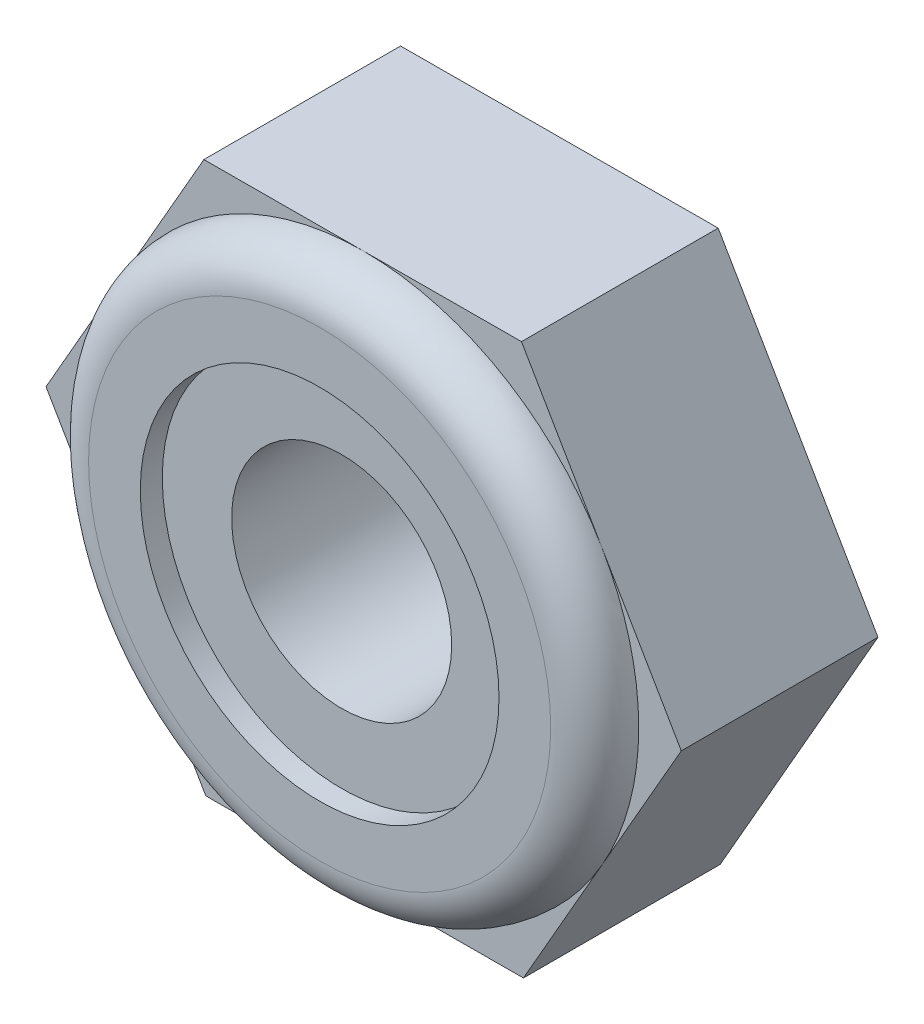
ISO-10303-21;
HEADER;
FILE_DESCRIPTION(('STEP AP214'),'2;1');
FILE_NAME('part.step','',(''),(''),'','','');
FILE_SCHEMA(('AUTOMOTIVE_DESIGN { 1 0 10303 214 1 1 1 1 }'));
ENDSEC;
DATA;
#1=APPLICATION_CONTEXT('core data for automotive mechanical design processes');
#2=APPLICATION_PROTOCOL_DEFINITION('international standard','automotive_design',2000,#1);
#3=PRODUCT_CONTEXT('',#1,'mechanical');
#4=PRODUCT('Part','Part','',(#3));
#5=PRODUCT_RELATED_PRODUCT_CATEGORY('part','',(#4));
#6=PRODUCT_DEFINITION_FORMATION('','',#4);
#7=PRODUCT_DEFINITION_CONTEXT('part definition',#1,'design');
#8=PRODUCT_DEFINITION('design','',#6,#7);
#9=PRODUCT_DEFINITION_SHAPE('','',#8);
#10=(LENGTH_UNIT() NAMED_UNIT(*) SI_UNIT(.MILLI.,.METRE.));
#11=(NAMED_UNIT(*) PLANE_ANGLE_UNIT() SI_UNIT($,.RADIAN.));
#12=(NAMED_UNIT(*) SI_UNIT($,.STERADIAN.) SOLID_ANGLE_UNIT());
#13=UNCERTAINTY_MEASURE_WITH_UNIT(LENGTH_MEASURE(1.E-05),#10,'distance_accuracy_value','');
#14=(GEOMETRIC_REPRESENTATION_CONTEXT(3) GLOBAL_UNCERTAINTY_ASSIGNED_CONTEXT((#13)) GLOBAL_UNIT_ASSIGNED_CONTEXT((#10,
#11,#12)) REPRESENTATION_CONTEXT('',''));
#15=CARTESIAN_POINT('',(0.,0.,0.));
#16=DIRECTION('',(0.,0.,1.));
#17=DIRECTION('',(1.,0.,0.));
#18=AXIS2_PLACEMENT_3D('',#15,#16,#17);
#19=CARTESIAN_POINT('',(0.,0.,0.));
#20=DIRECTION('',(0.,0.,1.));
#21=DIRECTION('',(1.,0.,0.));
#22=AXIS2_PLACEMENT_3D('',#19,#20,#21);
#23=CYLINDRICAL_SURFACE('',#22,1.27);
#24=CARTESIAN_POINT('',(0.,0.,0.));
#25=DIRECTION('',(0.,0.,1.));
#26=DIRECTION('',(1.,0.,0.));
#27=AXIS2_PLACEMENT_3D('',#24,#25,#26);
#28=CIRCLE('',#27,1.27);
#29=CARTESIAN_POINT('',(1.27,0.,0.));
#30=VERTEX_POINT('',#29);
#31=EDGE_CURVE('E131',#30,#30,#28,.T.);
#32=ORIENTED_EDGE('',*,*,#31,.F.);
#33=EDGE_LOOP('',(#32));
#34=FACE_BOUND('',#33,.T.);
#35=CARTESIAN_POINT('',(0.,0.,2.524125));
#36=DIRECTION('',(0.,0.,1.));
#37=DIRECTION('',(1.,0.,0.));
#38=AXIS2_PLACEMENT_3D('',#35,#36,#37);
#39=CIRCLE('',#38,1.27);
#40=CARTESIAN_POINT('',(1.27,0.,2.524125));
#41=VERTEX_POINT('',#40);
#42=EDGE_CURVE('E34',#41,#41,#39,.F.);
#43=ORIENTED_EDGE('',*,*,#42,.F.);
#44=EDGE_LOOP('',(#43));
#45=FACE_BOUND('',#44,.T.);
#46=ADVANCED_FACE('F30',(#34,#45),#23,.F.);
#47=CARTESIAN_POINT('',(-1.8218133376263,-3.18148227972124,2.270125));
#48=DIRECTION('',(0.,0.,-1.));
#49=DIRECTION('',(-1.,0.,0.));
#50=AXIS2_PLACEMENT_3D('',#47,#48,#49);
#51=PLANE('',#50);
#52=CARTESIAN_POINT('',(0.,0.,2.270125));
#53=DIRECTION('',(0.,0.,1.));
#54=DIRECTION('',(1.,0.,0.));
#55=AXIS2_PLACEMENT_3D('',#52,#53,#54);
#56=CIRCLE('',#55,3.175);
#57=CARTESIAN_POINT('',(2.74398224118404,1.59724339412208,2.270125));
#58=VERTEX_POINT('',#57);
#59=CARTESIAN_POINT('',(-0.0112622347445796,3.17498002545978,2.270125));
#60=VERTEX_POINT('',#59);
#61=EDGE_CURVE('E125',#58,#60,#56,.T.);
#62=ORIENTED_EDGE('',*,*,#61,.F.);
#63=DIRECTION('',(-0.503068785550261,0.864246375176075,0.));
#64=VECTOR('',#63,1.);
#65=CARTESIAN_POINT('',(3.66615114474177,0.0130045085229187,2.270125));
#66=LINE('',#65,#64);
#67=CARTESIAN_POINT('',(1.82181333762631,3.18148227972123,2.270125));
#68=VERTEX_POINT('',#67);
#69=EDGE_CURVE('E113',#58,#68,#66,.T.);
#70=ORIENTED_EDGE('',*,*,#69,.T.);
#71=DIRECTION('',(-0.999993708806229,-0.00354716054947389,0.));
#72=VECTOR('',#71,1.);
#73=CARTESIAN_POINT('',(1.82181333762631,3.18148227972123,2.270125));
#74=LINE('',#73,#72);
#75=EDGE_CURVE('E127',#68,#60,#74,.T.);
#76=ORIENTED_EDGE('',*,*,#75,.T.);
#77=EDGE_LOOP('',(#62,#70,#76));
#78=FACE_BOUND('',#77,.T.);
#79=ADVANCED_FACE('F126',(#78),#51,.F.);
#80=CARTESIAN_POINT('',(-2.75524447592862,1.5777366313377,2.270125));
#81=VERTEX_POINT('',#80);
#82=EDGE_CURVE('E39',#60,#81,#56,.T.);
#83=ORIENTED_EDGE('',*,*,#82,.F.);
#84=CARTESIAN_POINT('',(-1.84433780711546,3.16847777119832,2.270125));
#85=VERTEX_POINT('',#84);
#86=EDGE_CURVE('E112',#60,#85,#74,.T.);
#87=ORIENTED_EDGE('',*,*,#86,.T.);
#88=DIRECTION('',(-0.496924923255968,-0.867793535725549,0.));
#89=VECTOR('',#88,1.);
#90=CARTESIAN_POINT('',(-1.84433780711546,3.16847777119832,2.270125));
#91=LINE('',#90,#89);
#92=EDGE_CURVE('E164',#85,#81,#91,.T.);
#93=ORIENTED_EDGE('',*,*,#92,.T.);
#94=EDGE_LOOP('',(#83,#87,#93));
#95=FACE_BOUND('',#94,.T.);
#96=ADVANCED_FACE('F197',(#95),#51,.F.);
#97=CARTESIAN_POINT('',(-2.74398224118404,-1.59724339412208,2.270125));
#98=VERTEX_POINT('',#97);
#99=EDGE_CURVE('E54',#81,#98,#56,.T.);
#100=ORIENTED_EDGE('',*,*,#99,.F.);
#101=CARTESIAN_POINT('',(-3.66615114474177,-0.0130045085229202,2.270125));
#102=VERTEX_POINT('',#101);
#103=EDGE_CURVE('E163',#81,#102,#91,.T.);
#104=ORIENTED_EDGE('',*,*,#103,.T.);
#105=DIRECTION('',(0.503068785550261,-0.864246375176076,0.));
#106=VECTOR('',#105,1.);
#107=CARTESIAN_POINT('',(-3.66615114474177,-0.0130045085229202,2.270125));
#108=LINE('',#107,#106);
#109=EDGE_CURVE('E168',#102,#98,#108,.T.);
#110=ORIENTED_EDGE('',*,*,#109,.T.);
#111=EDGE_LOOP('',(#100,#104,#110));
#112=FACE_BOUND('',#111,.T.);
#113=ADVANCED_FACE('F210',(#112),#51,.F.);
#114=CARTESIAN_POINT('',(0.0112622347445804,-3.17498002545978,2.270125));
#115=VERTEX_POINT('',#114);
#116=EDGE_CURVE('E46',#98,#115,#56,.T.);
#117=ORIENTED_EDGE('',*,*,#116,.F.);
#118=CARTESIAN_POINT('',(-1.8218133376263,-3.18148227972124,2.270125));
#119=VERTEX_POINT('',#118);
#120=EDGE_CURVE('E167',#98,#119,#108,.T.);
#121=ORIENTED_EDGE('',*,*,#120,.T.);
#122=DIRECTION('',(0.999993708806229,0.00354716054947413,0.));
#123=VECTOR('',#122,1.);
#124=CARTESIAN_POINT('',(-1.8218133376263,-3.18148227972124,2.270125));
#125=LINE('',#124,#123);
#126=EDGE_CURVE('E158',#119,#115,#125,.T.);
#127=ORIENTED_EDGE('',*,*,#126,.T.);
#128=EDGE_LOOP('',(#117,#121,#127));
#129=FACE_BOUND('',#128,.T.);
#130=ADVANCED_FACE('F205',(#129),#51,.F.);
#131=CARTESIAN_POINT('',(2.75524447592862,-1.5777366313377,2.270125));
#132=VERTEX_POINT('',#131);
#133=EDGE_CURVE('E137',#115,#132,#56,.T.);
#134=ORIENTED_EDGE('',*,*,#133,.F.);
#135=CARTESIAN_POINT('',(1.84433780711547,-3.16847777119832,2.270125));
#136=VERTEX_POINT('',#135);
#137=EDGE_CURVE('E157',#115,#136,#125,.T.);
#138=ORIENTED_EDGE('',*,*,#137,.T.);
#139=DIRECTION('',(0.496924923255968,0.86779353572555,0.));
#140=VECTOR('',#139,1.);
#141=CARTESIAN_POINT('',(1.84433780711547,-3.16847777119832,2.270125));
#142=LINE('',#141,#140);
#143=EDGE_CURVE('E123',#136,#132,#142,.T.);
#144=ORIENTED_EDGE('',*,*,#143,.T.);
#145=EDGE_LOOP('',(#134,#138,#144));
#146=FACE_BOUND('',#145,.T.);
#147=ADVANCED_FACE('F200',(#146),#51,.F.);
#148=EDGE_CURVE('E106',#132,#58,#56,.T.);
#149=ORIENTED_EDGE('',*,*,#148,.F.);
#150=CARTESIAN_POINT('',(3.66615114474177,0.0130045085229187,2.270125));
#151=VERTEX_POINT('',#150);
#152=EDGE_CURVE('E108',#132,#151,#142,.T.);
#153=ORIENTED_EDGE('',*,*,#152,.T.);
#154=EDGE_CURVE('E102',#151,#58,#66,.T.);
#155=ORIENTED_EDGE('',*,*,#154,.T.);
#156=EDGE_LOOP('',(#149,#153,#155));
#157=FACE_BOUND('',#156,.T.);
#158=ADVANCED_FACE('F104',(#157),#51,.F.);
#159=CARTESIAN_POINT('',(-1.8218133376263,-3.18148227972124,2.270125));
#160=DIRECTION('',(-0.00354716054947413,0.999993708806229,0.));
#161=DIRECTION('',(-0.999993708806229,-0.00354716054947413,0.));
#162=AXIS2_PLACEMENT_3D('',#159,#160,#161);
#163=PLANE('',#162);
#164=DIRECTION('',(0.999993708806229,0.00354716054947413,0.));
#165=VECTOR('',#164,1.);
#166=CARTESIAN_POINT('',(-1.8218133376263,-3.18148227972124,0.));
#167=LINE('',#166,#165);
#168=CARTESIAN_POINT('',(-1.8218133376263,-3.18148227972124,0.));
#169=VERTEX_POINT('',#168);
#170=CARTESIAN_POINT('',(1.84433780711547,-3.16847777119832,0.));
#171=VERTEX_POINT('',#170);
#172=EDGE_CURVE('E130',#169,#171,#167,.T.);
#173=ORIENTED_EDGE('',*,*,#172,.T.);
#174=DIRECTION('',(0.,0.,-1.));
#175=VECTOR('',#174,1.);
#176=CARTESIAN_POINT('',(1.84433780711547,-3.16847777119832,2.270125));
#177=LINE('',#176,#175);
#178=EDGE_CURVE('E138',#136,#171,#177,.T.);
#179=ORIENTED_EDGE('',*,*,#178,.F.);
#180=ORIENTED_EDGE('',*,*,#137,.F.);
#181=ORIENTED_EDGE('',*,*,#126,.F.);
#182=DIRECTION('',(0.,0.,-1.));
#183=VECTOR('',#182,1.);
#184=CARTESIAN_POINT('',(-1.8218133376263,-3.18148227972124,2.270125));
#185=LINE('',#184,#183);
#186=EDGE_CURVE('E170',#119,#169,#185,.T.);
#187=ORIENTED_EDGE('',*,*,#186,.T.);
#188=EDGE_LOOP('',(#173,#179,#180,#181,#187));
#189=FACE_BOUND('',#188,.T.);
#190=ADVANCED_FACE('F32',(#189),#163,.F.);
#191=CARTESIAN_POINT('',(1.84433780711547,-3.16847777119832,2.270125));
#192=DIRECTION('',(-0.867793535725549,0.496924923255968,0.));
#193=DIRECTION('',(-0.496924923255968,-0.86779353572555,0.));
#194=AXIS2_PLACEMENT_3D('',#191,#192,#193);
#195=PLANE('',#194);
#196=DIRECTION('',(0.496924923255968,0.86779353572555,0.));
#197=VECTOR('',#196,1.);
#198=CARTESIAN_POINT('',(1.84433780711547,-3.16847777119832,0.));
#199=LINE('',#198,#197);
#200=CARTESIAN_POINT('',(3.66615114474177,0.0130045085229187,0.));
#201=VERTEX_POINT('',#200);
#202=EDGE_CURVE('E147',#171,#201,#199,.T.);
#203=ORIENTED_EDGE('',*,*,#202,.T.);
#204=DIRECTION('',(0.,0.,-1.));
#205=VECTOR('',#204,1.);
#206=CARTESIAN_POINT('',(3.66615114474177,0.0130045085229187,2.270125));
#207=LINE('',#206,#205);
#208=EDGE_CURVE('E140',#151,#201,#207,.T.);
#209=ORIENTED_EDGE('',*,*,#208,.F.);
#210=ORIENTED_EDGE('',*,*,#152,.F.);
#211=ORIENTED_EDGE('',*,*,#143,.F.);
#212=ORIENTED_EDGE('',*,*,#178,.T.);
#213=EDGE_LOOP('',(#203,#209,#210,#211,#212));
#214=FACE_BOUND('',#213,.T.);
#215=ADVANCED_FACE('F329',(#214),#195,.F.);
#216=CARTESIAN_POINT('',(3.66615114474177,0.0130045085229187,2.270125));
#217=DIRECTION('',(-0.864246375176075,-0.503068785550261,0.));
#218=DIRECTION('',(0.503068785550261,-0.864246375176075,0.));
#219=AXIS2_PLACEMENT_3D('',#216,#217,#218);
#220=PLANE('',#219);
#221=DIRECTION('',(-0.503068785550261,0.864246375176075,0.));
#222=VECTOR('',#221,1.);
#223=CARTESIAN_POINT('',(3.66615114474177,0.0130045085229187,0.));
#224=LINE('',#223,#222);
#225=CARTESIAN_POINT('',(1.82181333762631,3.18148227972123,0.));
#226=VERTEX_POINT('',#225);
#227=EDGE_CURVE('E149',#201,#226,#224,.T.);
#228=ORIENTED_EDGE('',*,*,#227,.T.);
#229=DIRECTION('',(0.,0.,-1.));
#230=VECTOR('',#229,1.);
#231=CARTESIAN_POINT('',(1.82181333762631,3.18148227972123,2.270125));
#232=LINE('',#231,#230);
#233=EDGE_CURVE('E119',#68,#226,#232,.T.);
#234=ORIENTED_EDGE('',*,*,#233,.F.);
#235=ORIENTED_EDGE('',*,*,#69,.F.);
#236=ORIENTED_EDGE('',*,*,#154,.F.);
#237=ORIENTED_EDGE('',*,*,#208,.T.);
#238=EDGE_LOOP('',(#228,#234,#235,#236,#237));
#239=FACE_BOUND('',#238,.T.);
#240=ADVANCED_FACE('F117',(#239),#220,.F.);
#241=CARTESIAN_POINT('',(1.82181333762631,3.18148227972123,2.270125));
#242=DIRECTION('',(0.00354716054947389,-0.999993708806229,0.));
#243=DIRECTION('',(0.999993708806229,0.00354716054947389,0.));
#244=AXIS2_PLACEMENT_3D('',#241,#242,#243);
#245=PLANE('',#244);
#246=DIRECTION('',(-0.999993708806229,-0.00354716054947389,0.));
#247=VECTOR('',#246,1.);
#248=CARTESIAN_POINT('',(1.82181333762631,3.18148227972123,0.));
#249=LINE('',#248,#247);
#250=CARTESIAN_POINT('',(-1.84433780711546,3.16847777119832,0.));
#251=VERTEX_POINT('',#250);
#252=EDGE_CURVE('E151',#226,#251,#249,.T.);
#253=ORIENTED_EDGE('',*,*,#252,.T.);
#254=DIRECTION('',(0.,0.,-1.));
#255=VECTOR('',#254,1.);
#256=CARTESIAN_POINT('',(-1.84433780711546,3.16847777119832,2.270125));
#257=LINE('',#256,#255);
#258=EDGE_CURVE('E176',#85,#251,#257,.T.);
#259=ORIENTED_EDGE('',*,*,#258,.F.);
#260=ORIENTED_EDGE('',*,*,#86,.F.);
#261=ORIENTED_EDGE('',*,*,#75,.F.);
#262=ORIENTED_EDGE('',*,*,#233,.T.);
#263=EDGE_LOOP('',(#253,#259,#260,#261,#262));
#264=FACE_BOUND('',#263,.T.);
#265=ADVANCED_FACE('F190',(#264),#245,.F.);
#266=CARTESIAN_POINT('',(-1.84433780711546,3.16847777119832,2.270125));
#267=DIRECTION('',(0.867793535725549,-0.496924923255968,0.));
#268=DIRECTION('',(0.496924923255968,0.867793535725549,0.));
#269=AXIS2_PLACEMENT_3D('',#266,#267,#268);
#270=PLANE('',#269);
#271=DIRECTION('',(-0.496924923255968,-0.867793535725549,0.));
#272=VECTOR('',#271,1.);
#273=CARTESIAN_POINT('',(-1.84433780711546,3.16847777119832,0.));
#274=LINE('',#273,#272);
#275=CARTESIAN_POINT('',(-3.66615114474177,-0.0130045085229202,0.));
#276=VERTEX_POINT('',#275);
#277=EDGE_CURVE('E153',#251,#276,#274,.T.);
#278=ORIENTED_EDGE('',*,*,#277,.T.);
#279=DIRECTION('',(0.,0.,-1.));
#280=VECTOR('',#279,1.);
#281=CARTESIAN_POINT('',(-3.66615114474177,-0.0130045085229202,2.270125));
#282=LINE('',#281,#280);
#283=EDGE_CURVE('E173',#102,#276,#282,.T.);
#284=ORIENTED_EDGE('',*,*,#283,.F.);
#285=ORIENTED_EDGE('',*,*,#103,.F.);
#286=ORIENTED_EDGE('',*,*,#92,.F.);
#287=ORIENTED_EDGE('',*,*,#258,.T.);
#288=EDGE_LOOP('',(#278,#284,#285,#286,#287));
#289=FACE_BOUND('',#288,.T.);
#290=ADVANCED_FACE('F194',(#289),#270,.F.);
#291=CARTESIAN_POINT('',(-3.66615114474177,-0.0130045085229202,2.270125));
#292=DIRECTION('',(0.864246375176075,0.503068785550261,0.));
#293=DIRECTION('',(-0.503068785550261,0.864246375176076,0.));
#294=AXIS2_PLACEMENT_3D('',#291,#292,#293);
#295=PLANE('',#294);
#296=DIRECTION('',(0.503068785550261,-0.864246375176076,0.));
#297=VECTOR('',#296,1.);
#298=CARTESIAN_POINT('',(-3.66615114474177,-0.0130045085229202,0.));
#299=LINE('',#298,#297);
#300=EDGE_CURVE('E155',#276,#169,#299,.T.);
#301=ORIENTED_EDGE('',*,*,#300,.T.);
#302=ORIENTED_EDGE('',*,*,#186,.F.);
#303=ORIENTED_EDGE('',*,*,#120,.F.);
#304=ORIENTED_EDGE('',*,*,#109,.F.);
#305=ORIENTED_EDGE('',*,*,#283,.T.);
#306=EDGE_LOOP('',(#301,#302,#303,#304,#305));
#307=FACE_BOUND('',#306,.T.);
#308=ADVANCED_FACE('F209',(#307),#295,.F.);
#309=CARTESIAN_POINT('',(-1.8218133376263,-3.18148227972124,0.));
#310=DIRECTION('',(0.,0.,-1.));
#311=DIRECTION('',(-1.,0.,0.));
#312=AXIS2_PLACEMENT_3D('',#309,#310,#311);
#313=PLANE('',#312);
#314=ORIENTED_EDGE('',*,*,#31,.T.);
#315=EDGE_LOOP('',(#314));
#316=FACE_BOUND('',#315,.T.);
#317=ORIENTED_EDGE('',*,*,#172,.F.);
#318=ORIENTED_EDGE('',*,*,#300,.F.);
#319=ORIENTED_EDGE('',*,*,#277,.F.);
#320=ORIENTED_EDGE('',*,*,#252,.F.);
#321=ORIENTED_EDGE('',*,*,#227,.F.);
#322=ORIENTED_EDGE('',*,*,#202,.F.);
#323=EDGE_LOOP('',(#317,#318,#319,#320,#321,#322));
#324=FACE_BOUND('',#323,.T.);
#325=ADVANCED_FACE('F185',(#316,#324),#313,.T.);
#326=CARTESIAN_POINT('',(0.,0.,2.778125));
#327=DIRECTION('',(0.,0.,1.));
#328=DIRECTION('',(1.,0.,0.));
#329=AXIS2_PLACEMENT_3D('',#326,#327,#328);
#330=PLANE('',#329);
#331=CARTESIAN_POINT('',(0.,0.,2.778125));
#332=DIRECTION('',(0.,0.,1.));
#333=DIRECTION('',(1.,0.,0.));
#334=AXIS2_PLACEMENT_3D('',#331,#332,#333);
#335=CIRCLE('',#334,2.07017928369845);
#336=CARTESIAN_POINT('',(2.07017928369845,0.,2.778125));
#337=VERTEX_POINT('',#336);
#338=EDGE_CURVE('E248',#337,#337,#335,.T.);
#339=ORIENTED_EDGE('',*,*,#338,.F.);
#340=EDGE_LOOP('',(#339));
#341=FACE_BOUND('',#340,.T.);
#342=CARTESIAN_POINT('',(0.,0.,2.778125));
#343=DIRECTION('',(0.,0.,1.));
#344=DIRECTION('',(1.,0.,0.));
#345=AXIS2_PLACEMENT_3D('',#342,#343,#344);
#346=CIRCLE('',#345,2.667);
#347=CARTESIAN_POINT('',(2.667,0.,2.778125));
#348=VERTEX_POINT('',#347);
#349=EDGE_CURVE('E11',#348,#348,#346,.T.);
#350=ORIENTED_EDGE('',*,*,#349,.T.);
#351=EDGE_LOOP('',(#350));
#352=FACE_BOUND('',#351,.T.);
#353=ADVANCED_FACE('F234',(#341,#352),#330,.T.);
#354=CARTESIAN_POINT('',(0.,0.,2.270125));
#355=DIRECTION('',(0.,0.,1.));
#356=DIRECTION('',(1.,0.,0.));
#357=AXIS2_PLACEMENT_3D('',#354,#355,#356);
#358=TOROIDAL_SURFACE('',#357,2.667,0.508);
#359=ORIENTED_EDGE('',*,*,#116,.T.);
#360=ORIENTED_EDGE('',*,*,#133,.T.);
#361=ORIENTED_EDGE('',*,*,#148,.T.);
#362=ORIENTED_EDGE('',*,*,#61,.T.);
#363=ORIENTED_EDGE('',*,*,#82,.T.);
#364=ORIENTED_EDGE('',*,*,#99,.T.);
#365=EDGE_LOOP('',(#359,#360,#361,#362,#363,#364));
#366=FACE_BOUND('',#365,.T.);
#367=ORIENTED_EDGE('',*,*,#349,.F.);
#368=EDGE_LOOP('',(#367));
#369=FACE_BOUND('',#368,.T.);
#370=ADVANCED_FACE('F134',(#366,#369),#358,.T.);
#371=CARTESIAN_POINT('',(0.,0.,2.524125));
#372=DIRECTION('',(0.,0.,1.));
#373=DIRECTION('',(1.,0.,0.));
#374=AXIS2_PLACEMENT_3D('',#371,#372,#373);
#375=PLANE('',#374);
#376=CARTESIAN_POINT('',(0.,0.,2.524125));
#377=DIRECTION('',(0.,0.,1.));
#378=DIRECTION('',(1.,0.,0.));
#379=AXIS2_PLACEMENT_3D('',#376,#377,#378);
#380=CIRCLE('',#379,2.07017928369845);
#381=CARTESIAN_POINT('',(2.07017928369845,0.,2.524125));
#382=VERTEX_POINT('',#381);
#383=EDGE_CURVE('E244',#382,#382,#380,.T.);
#384=ORIENTED_EDGE('',*,*,#383,.T.);
#385=EDGE_LOOP('',(#384));
#386=FACE_BOUND('',#385,.T.);
#387=ORIENTED_EDGE('',*,*,#42,.T.);
#388=EDGE_LOOP('',(#387));
#389=FACE_BOUND('',#388,.T.);
#390=ADVANCED_FACE('F233',(#386,#389),#375,.T.);
#391=CARTESIAN_POINT('',(0.,0.,2.524125));
#392=DIRECTION('',(0.,0.,1.));
#393=DIRECTION('',(1.,0.,0.));
#394=AXIS2_PLACEMENT_3D('',#391,#392,#393);
#395=CYLINDRICAL_SURFACE('',#394,2.07017928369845);
#396=ORIENTED_EDGE('',*,*,#383,.F.);
#397=EDGE_LOOP('',(#396));
#398=FACE_BOUND('',#397,.T.);
#399=ORIENTED_EDGE('',*,*,#338,.T.);
#400=EDGE_LOOP('',(#399));
#401=FACE_BOUND('',#400,.T.);
#402=ADVANCED_FACE('F229',(#398,#401),#395,.F.);
#403=CLOSED_SHELL('',(#46,#79,#96,#113,#130,#147,#158,#190,#215,#240,#265,#290,#308,#325,#353,
#370,#390,#402));
#404=MANIFOLD_SOLID_BREP('B2',#403);
#405=ADVANCED_BREP_SHAPE_REPRESENTATION('',(#18,#404),#14);
#406=SHAPE_DEFINITION_REPRESENTATION(#9,#405);
ENDSEC;
END-ISO-10303-21;
